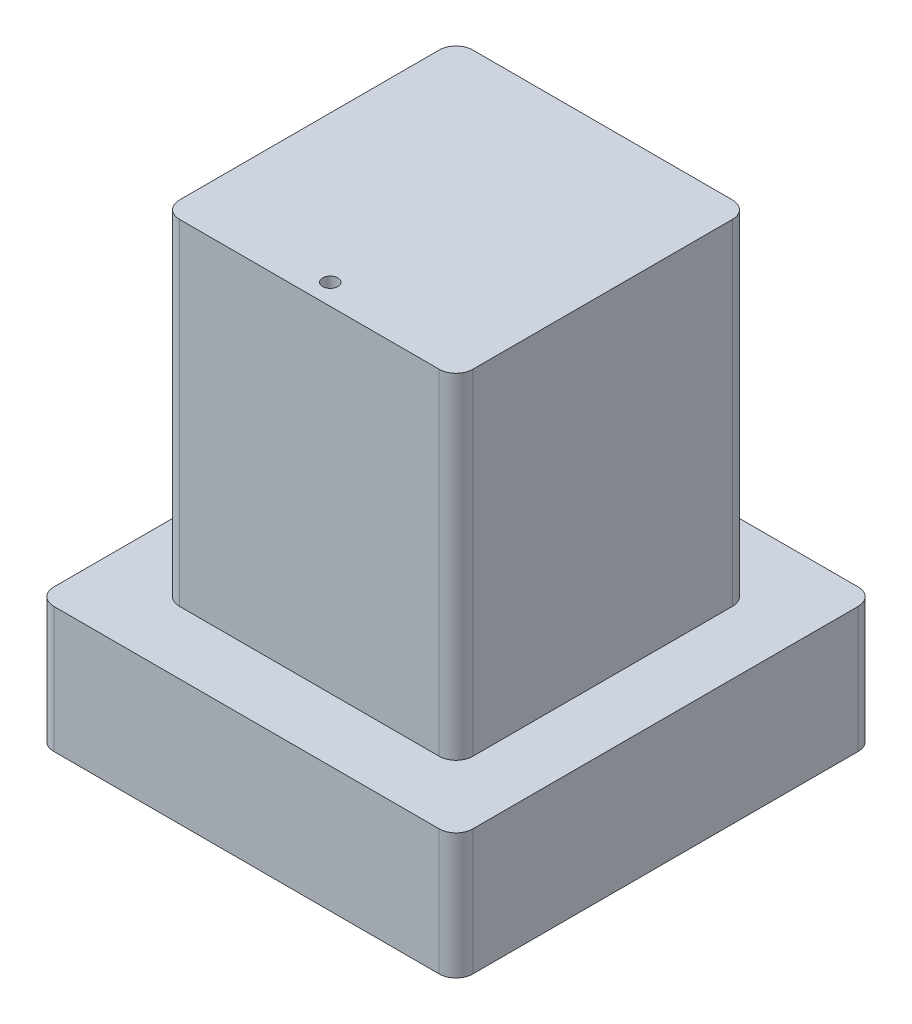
from build123d import *

# Parameters (mm, degrees)
SKETCH1_W           = 127
SKETCH1_H           = 127
BOSS_EXTRUDE1_DEPTH = 38.1
SKETCH2_W           = 88.9
SKETCH2_H           = 88.9
BOSS_EXTRUDE2_DEPTH = 101.6
FILLET1_R           = 5.08
FILLET2_R           = 5.08
SKETCH3_R           = 2.2987
CUT_EXTRUDE1_DEPTH  = 6.35


with BuildPart() as part:
    # Sketch1 → Boss-Extrude1 (new body)
    with BuildSketch(Plane(origin=(0, 0, 0), x_dir=(1, 0, 0), z_dir=(0, 1, 0))):
        Rectangle(SKETCH1_W, SKETCH1_H)
    extrude(amount=BOSS_EXTRUDE1_DEPTH)

    # Fillet1
    fillet1_edges = [part.edges().sort_by_distance(p)[0] for p in [
        (-63.5, 19.05, -63.5),
        (63.5, 19.05, -63.5),
        (63.5, 19.05, 63.5),
        (-63.5, 19.05, 63.5),
    ]]
    fillet(fillet1_edges, radius=FILLET1_R)


with BuildPart() as body_2:
    # Sketch2 → Boss-Extrude2 (new body)
    with BuildSketch(Plane(origin=(0, 38.1, 0), x_dir=(1, 0, 0), z_dir=(0, 1, 0))):
        Rectangle(SKETCH2_W, SKETCH2_H)
    extrude(amount=BOSS_EXTRUDE2_DEPTH)

    # Fillet2
    fillet2_edges = [body_2.edges().sort_by_distance(p)[0] for p in [
        (-44.45, 88.9, -44.45),
        (44.45, 88.9, -44.45),
        (44.45, 88.9, 44.45),
        (-44.45, 88.9, 44.45),
    ]]
    fillet(fillet2_edges, radius=FILLET2_R)

    # Sketch3 → Cut-Extrude1 (cut)
    with BuildSketch(Plane(origin=(0, 139.7, 0), x_dir=(1, 0, 0), z_dir=(0, 1, 0))):
        with Locations(Location((0, -38.1, 0), (0, 0, 270))):
            Circle(SKETCH3_R)
    extrude(amount=-CUT_EXTRUDE1_DEPTH, mode=Mode.SUBTRACT)


solid = Compound([part.part, body_2.part])
